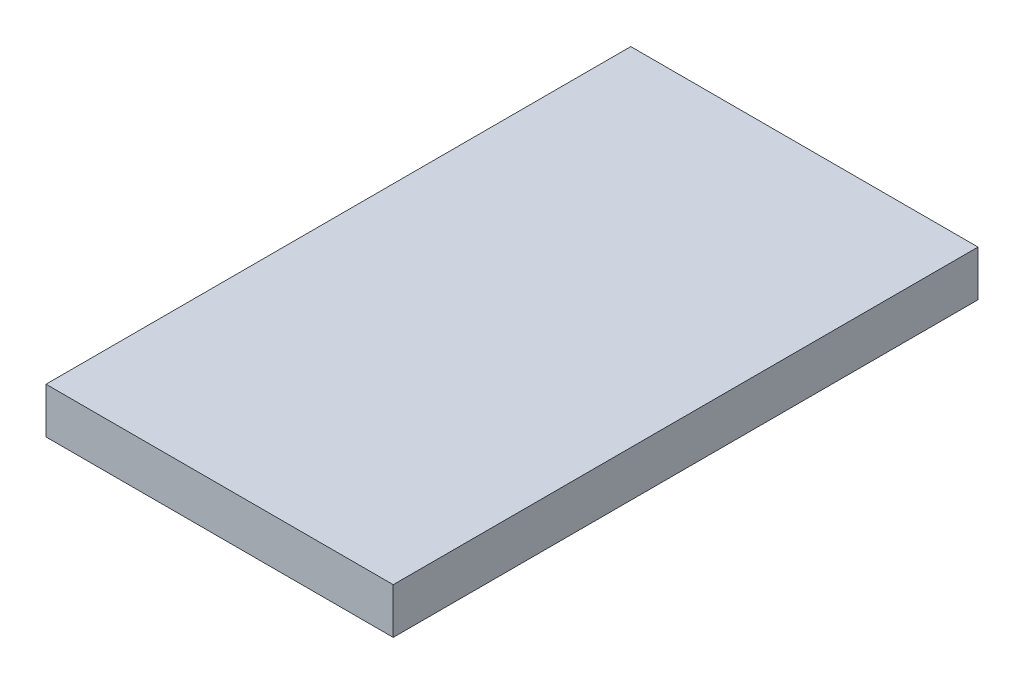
ISO-10303-21;
HEADER;
FILE_DESCRIPTION(('STEP AP214'),'2;1');
FILE_NAME('part.step','',(''),(''),'','','');
FILE_SCHEMA(('AUTOMOTIVE_DESIGN { 1 0 10303 214 1 1 1 1 }'));
ENDSEC;
DATA;
#1=APPLICATION_CONTEXT('core data for automotive mechanical design processes');
#2=APPLICATION_PROTOCOL_DEFINITION('international standard','automotive_design',2000,#1);
#3=PRODUCT_CONTEXT('',#1,'mechanical');
#4=PRODUCT('Part','Part','',(#3));
#5=PRODUCT_RELATED_PRODUCT_CATEGORY('part','',(#4));
#6=PRODUCT_DEFINITION_FORMATION('','',#4);
#7=PRODUCT_DEFINITION_CONTEXT('part definition',#1,'design');
#8=PRODUCT_DEFINITION('design','',#6,#7);
#9=PRODUCT_DEFINITION_SHAPE('','',#8);
#10=(LENGTH_UNIT() NAMED_UNIT(*) SI_UNIT(.MILLI.,.METRE.));
#11=(NAMED_UNIT(*) PLANE_ANGLE_UNIT() SI_UNIT($,.RADIAN.));
#12=(NAMED_UNIT(*) SI_UNIT($,.STERADIAN.) SOLID_ANGLE_UNIT());
#13=UNCERTAINTY_MEASURE_WITH_UNIT(LENGTH_MEASURE(1.E-05),#10,'distance_accuracy_value','');
#14=(GEOMETRIC_REPRESENTATION_CONTEXT(3) GLOBAL_UNCERTAINTY_ASSIGNED_CONTEXT((#13)) GLOBAL_UNIT_ASSIGNED_CONTEXT((#10,
#11,#12)) REPRESENTATION_CONTEXT('',''));
#15=CARTESIAN_POINT('',(0.,0.,0.));
#16=DIRECTION('',(0.,0.,1.));
#17=DIRECTION('',(1.,0.,0.));
#18=AXIS2_PLACEMENT_3D('',#15,#16,#17);
#19=CARTESIAN_POINT('',(19.,5.,-32.));
#20=DIRECTION('',(-1.,0.,0.));
#21=DIRECTION('',(0.,0.,1.));
#22=AXIS2_PLACEMENT_3D('',#19,#20,#21);
#23=PLANE('',#22);
#24=DIRECTION('',(0.,0.,-1.));
#25=VECTOR('',#24,1.);
#26=CARTESIAN_POINT('',(19.,0.,-32.));
#27=LINE('',#26,#25);
#28=CARTESIAN_POINT('',(19.,0.,32.));
#29=VERTEX_POINT('',#28);
#30=CARTESIAN_POINT('',(19.,0.,-32.));
#31=VERTEX_POINT('',#30);
#32=EDGE_CURVE('E96',#29,#31,#27,.T.);
#33=ORIENTED_EDGE('',*,*,#32,.T.);
#34=DIRECTION('',(0.,-1.,0.));
#35=VECTOR('',#34,1.);
#36=CARTESIAN_POINT('',(19.,5.,-32.));
#37=LINE('',#36,#35);
#38=CARTESIAN_POINT('',(19.,5.,-32.));
#39=VERTEX_POINT('',#38);
#40=EDGE_CURVE('E11',#39,#31,#37,.T.);
#41=ORIENTED_EDGE('',*,*,#40,.F.);
#42=DIRECTION('',(0.,0.,-1.));
#43=VECTOR('',#42,1.);
#44=CARTESIAN_POINT('',(19.,5.,-32.));
#45=LINE('',#44,#43);
#46=CARTESIAN_POINT('',(19.,5.,32.));
#47=VERTEX_POINT('',#46);
#48=EDGE_CURVE('E84',#47,#39,#45,.T.);
#49=ORIENTED_EDGE('',*,*,#48,.F.);
#50=DIRECTION('',(0.,-1.,0.));
#51=VECTOR('',#50,1.);
#52=CARTESIAN_POINT('',(19.,5.,32.));
#53=LINE('',#52,#51);
#54=EDGE_CURVE('E92',#47,#29,#53,.T.);
#55=ORIENTED_EDGE('',*,*,#54,.T.);
#56=EDGE_LOOP('',(#33,#41,#49,#55));
#57=FACE_BOUND('',#56,.T.);
#58=ADVANCED_FACE('F33',(#57),#23,.F.);
#59=CARTESIAN_POINT('',(-19.,5.,-32.));
#60=DIRECTION('',(0.,0.,1.));
#61=DIRECTION('',(1.,0.,0.));
#62=AXIS2_PLACEMENT_3D('',#59,#60,#61);
#63=PLANE('',#62);
#64=DIRECTION('',(-1.,0.,0.));
#65=VECTOR('',#64,1.);
#66=CARTESIAN_POINT('',(-19.,0.,-32.));
#67=LINE('',#66,#65);
#68=CARTESIAN_POINT('',(-19.,0.,-32.));
#69=VERTEX_POINT('',#68);
#70=EDGE_CURVE('E88',#31,#69,#67,.T.);
#71=ORIENTED_EDGE('',*,*,#70,.T.);
#72=DIRECTION('',(0.,-1.,0.));
#73=VECTOR('',#72,1.);
#74=CARTESIAN_POINT('',(-19.,5.,-32.));
#75=LINE('',#74,#73);
#76=CARTESIAN_POINT('',(-19.,5.,-32.));
#77=VERTEX_POINT('',#76);
#78=EDGE_CURVE('E41',#77,#69,#75,.T.);
#79=ORIENTED_EDGE('',*,*,#78,.F.);
#80=DIRECTION('',(-1.,0.,0.));
#81=VECTOR('',#80,1.);
#82=CARTESIAN_POINT('',(-19.,5.,-32.));
#83=LINE('',#82,#81);
#84=EDGE_CURVE('E79',#39,#77,#83,.T.);
#85=ORIENTED_EDGE('',*,*,#84,.F.);
#86=ORIENTED_EDGE('',*,*,#40,.T.);
#87=EDGE_LOOP('',(#71,#79,#85,#86));
#88=FACE_BOUND('',#87,.T.);
#89=ADVANCED_FACE('F87',(#88),#63,.F.);
#90=CARTESIAN_POINT('',(-19.,5.,-32.));
#91=DIRECTION('',(1.,0.,0.));
#92=DIRECTION('',(0.,0.,-1.));
#93=AXIS2_PLACEMENT_3D('',#90,#91,#92);
#94=PLANE('',#93);
#95=DIRECTION('',(0.,0.,1.));
#96=VECTOR('',#95,1.);
#97=CARTESIAN_POINT('',(-19.,0.,-32.));
#98=LINE('',#97,#96);
#99=CARTESIAN_POINT('',(-19.,0.,32.));
#100=VERTEX_POINT('',#99);
#101=EDGE_CURVE('E66',#69,#100,#98,.T.);
#102=ORIENTED_EDGE('',*,*,#101,.T.);
#103=DIRECTION('',(0.,-1.,0.));
#104=VECTOR('',#103,1.);
#105=CARTESIAN_POINT('',(-19.,5.,32.));
#106=LINE('',#105,#104);
#107=CARTESIAN_POINT('',(-19.,5.,32.));
#108=VERTEX_POINT('',#107);
#109=EDGE_CURVE('E89',#108,#100,#106,.T.);
#110=ORIENTED_EDGE('',*,*,#109,.F.);
#111=DIRECTION('',(0.,0.,1.));
#112=VECTOR('',#111,1.);
#113=CARTESIAN_POINT('',(-19.,5.,-32.));
#114=LINE('',#113,#112);
#115=EDGE_CURVE('E82',#77,#108,#114,.T.);
#116=ORIENTED_EDGE('',*,*,#115,.F.);
#117=ORIENTED_EDGE('',*,*,#78,.T.);
#118=EDGE_LOOP('',(#102,#110,#116,#117));
#119=FACE_BOUND('',#118,.T.);
#120=ADVANCED_FACE('F90',(#119),#94,.F.);
#121=CARTESIAN_POINT('',(-19.,5.,32.));
#122=DIRECTION('',(0.,0.,-1.));
#123=DIRECTION('',(-1.,0.,0.));
#124=AXIS2_PLACEMENT_3D('',#121,#122,#123);
#125=PLANE('',#124);
#126=DIRECTION('',(1.,0.,0.));
#127=VECTOR('',#126,1.);
#128=CARTESIAN_POINT('',(-19.,0.,32.));
#129=LINE('',#128,#127);
#130=EDGE_CURVE('E72',#100,#29,#129,.T.);
#131=ORIENTED_EDGE('',*,*,#130,.T.);
#132=ORIENTED_EDGE('',*,*,#54,.F.);
#133=DIRECTION('',(1.,0.,0.));
#134=VECTOR('',#133,1.);
#135=CARTESIAN_POINT('',(-19.,5.,32.));
#136=LINE('',#135,#134);
#137=EDGE_CURVE('E49',#108,#47,#136,.T.);
#138=ORIENTED_EDGE('',*,*,#137,.F.);
#139=ORIENTED_EDGE('',*,*,#109,.T.);
#140=EDGE_LOOP('',(#131,#132,#138,#139));
#141=FACE_BOUND('',#140,.T.);
#142=ADVANCED_FACE('F103',(#141),#125,.F.);
#143=CARTESIAN_POINT('',(0.,5.,0.));
#144=DIRECTION('',(0.,1.,0.));
#145=DIRECTION('',(0.,0.,1.));
#146=AXIS2_PLACEMENT_3D('',#143,#144,#145);
#147=PLANE('',#146);
#148=ORIENTED_EDGE('',*,*,#48,.T.);
#149=ORIENTED_EDGE('',*,*,#84,.T.);
#150=ORIENTED_EDGE('',*,*,#115,.T.);
#151=ORIENTED_EDGE('',*,*,#137,.T.);
#152=EDGE_LOOP('',(#148,#149,#150,#151));
#153=FACE_BOUND('',#152,.T.);
#154=ADVANCED_FACE('F80',(#153),#147,.T.);
#155=CARTESIAN_POINT('',(0.,0.,0.));
#156=DIRECTION('',(0.,1.,0.));
#157=DIRECTION('',(0.,0.,1.));
#158=AXIS2_PLACEMENT_3D('',#155,#156,#157);
#159=PLANE('',#158);
#160=ORIENTED_EDGE('',*,*,#32,.F.);
#161=ORIENTED_EDGE('',*,*,#130,.F.);
#162=ORIENTED_EDGE('',*,*,#101,.F.);
#163=ORIENTED_EDGE('',*,*,#70,.F.);
#164=EDGE_LOOP('',(#160,#161,#162,#163));
#165=FACE_BOUND('',#164,.T.);
#166=ADVANCED_FACE('F106',(#165),#159,.F.);
#167=CLOSED_SHELL('',(#58,#89,#120,#142,#154,#166));
#168=MANIFOLD_SOLID_BREP('B2',#167);
#169=ADVANCED_BREP_SHAPE_REPRESENTATION('',(#18,#168),#14);
#170=SHAPE_DEFINITION_REPRESENTATION(#9,#169);
ENDSEC;
END-ISO-10303-21;
